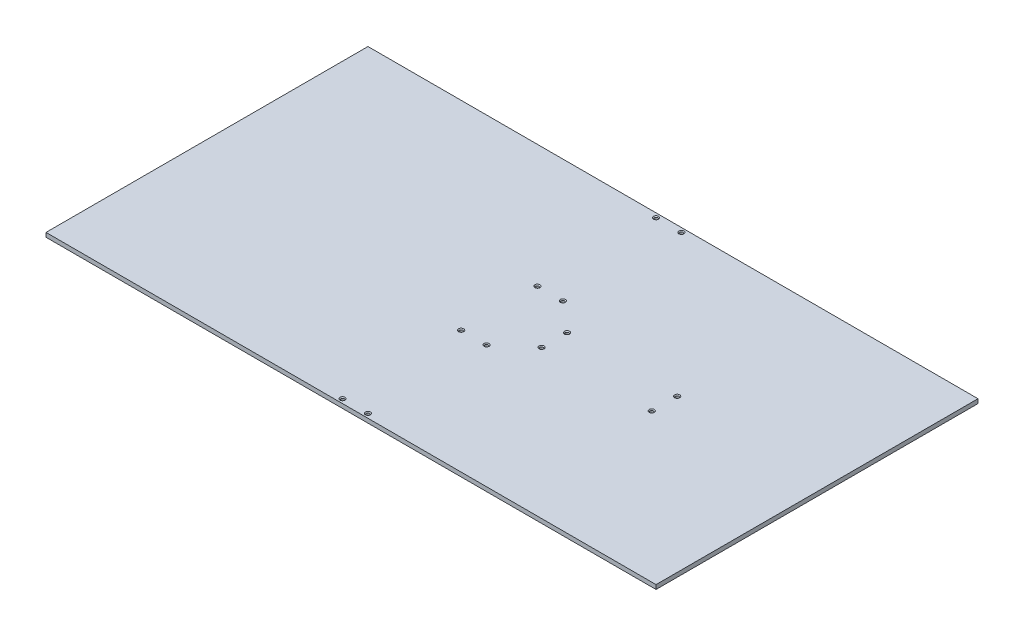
from build123d import *

# Parameters (mm, degrees)
SKETCH2_W                         = 914.4
SKETCH2_H                         = 482.6
BOSS_EXTRUDE1_DEPTH               = 6.35
F_1_4_20_TAPPED_HOLE1_D           = 5.1054
F_1_4_20_TAPPED_HOLE1_CSINK_D     = 7.62
F_1_4_20_TAPPED_HOLE1_CSINK_ANGLE = 90


with BuildPart() as part:
    # Sketch2 → Boss-Extrude1 (new body)
    with BuildSketch(Plane(origin=(0, 0, 0), x_dir=(1, 0, 0), z_dir=(0, 1, 0))):
        with Locations((457.2, 241.3)):
            Rectangle(SKETCH2_W, SKETCH2_H)
    extrude(amount=BOSS_EXTRUDE1_DEPTH)

    # 1_4-20 Tapped Hole1 (through all)
    with Locations(Plane(origin=(0, 6.35, 0), x_dir=(1, 0, 0), z_dir=(0, 1, 0))):
        with Locations((685.8, 222.25), (438.15, 298.45), (476.25, 298.45), (438.15, 184.15), (476.25, 184.15), (520.7, 260.35), (520.7, 222.25), (438.15, 476.25), (476.25, 476.25), (438.15, 6.35), (476.25, 6.35), (685.8, 260.35)):
            CounterSinkHole(F_1_4_20_TAPPED_HOLE1_D / 2, F_1_4_20_TAPPED_HOLE1_CSINK_D / 2, counter_sink_angle=F_1_4_20_TAPPED_HOLE1_CSINK_ANGLE)


solid = part.part
